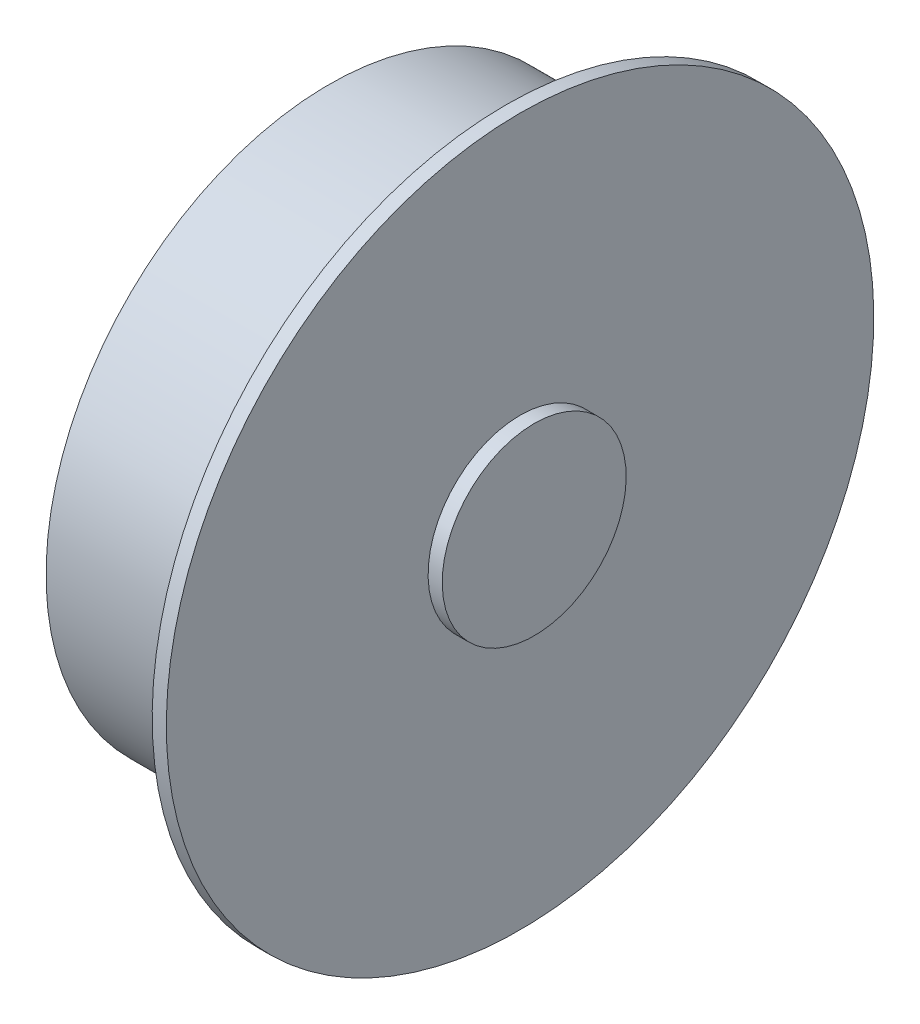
ISO-10303-21;
HEADER;
FILE_DESCRIPTION(('STEP AP214'),'2;1');
FILE_NAME('part.step','',(''),(''),'','','');
FILE_SCHEMA(('AUTOMOTIVE_DESIGN { 1 0 10303 214 1 1 1 1 }'));
ENDSEC;
DATA;
#1=APPLICATION_CONTEXT('core data for automotive mechanical design processes');
#2=APPLICATION_PROTOCOL_DEFINITION('international standard','automotive_design',2000,#1);
#3=PRODUCT_CONTEXT('',#1,'mechanical');
#4=PRODUCT('Part','Part','',(#3));
#5=PRODUCT_RELATED_PRODUCT_CATEGORY('part','',(#4));
#6=PRODUCT_DEFINITION_FORMATION('','',#4);
#7=PRODUCT_DEFINITION_CONTEXT('part definition',#1,'design');
#8=PRODUCT_DEFINITION('design','',#6,#7);
#9=PRODUCT_DEFINITION_SHAPE('','',#8);
#10=(LENGTH_UNIT() NAMED_UNIT(*) SI_UNIT(.MILLI.,.METRE.));
#11=(NAMED_UNIT(*) PLANE_ANGLE_UNIT() SI_UNIT($,.RADIAN.));
#12=(NAMED_UNIT(*) SI_UNIT($,.STERADIAN.) SOLID_ANGLE_UNIT());
#13=UNCERTAINTY_MEASURE_WITH_UNIT(LENGTH_MEASURE(1.E-05),#10,'distance_accuracy_value','');
#14=(GEOMETRIC_REPRESENTATION_CONTEXT(3) GLOBAL_UNCERTAINTY_ASSIGNED_CONTEXT((#13)) GLOBAL_UNIT_ASSIGNED_CONTEXT((#10,
#11,#12)) REPRESENTATION_CONTEXT('',''));
#15=CARTESIAN_POINT('',(0.,0.,0.));
#16=DIRECTION('',(0.,0.,1.));
#17=DIRECTION('',(1.,0.,0.));
#18=AXIS2_PLACEMENT_3D('',#15,#16,#17);
#19=CARTESIAN_POINT('',(4.,0.,0.));
#20=DIRECTION('',(-1.,0.,0.));
#21=DIRECTION('',(0.,-1.,0.));
#22=AXIS2_PLACEMENT_3D('',#19,#20,#21);
#23=CYLINDRICAL_SURFACE('',#22,13.);
#24=CARTESIAN_POINT('',(4.,0.,0.));
#25=DIRECTION('',(1.,0.,0.));
#26=DIRECTION('',(0.,1.,0.));
#27=AXIS2_PLACEMENT_3D('',#24,#25,#26);
#28=CIRCLE('',#27,13.);
#29=CARTESIAN_POINT('',(4.,13.,0.));
#30=VERTEX_POINT('',#29);
#31=EDGE_CURVE('E11',#30,#30,#28,.T.);
#32=ORIENTED_EDGE('',*,*,#31,.F.);
#33=EDGE_LOOP('',(#32));
#34=FACE_BOUND('',#33,.T.);
#35=CARTESIAN_POINT('',(2.,0.,0.));
#36=DIRECTION('',(1.,0.,0.));
#37=DIRECTION('',(0.,1.,0.));
#38=AXIS2_PLACEMENT_3D('',#35,#36,#37);
#39=CIRCLE('',#38,13.);
#40=CARTESIAN_POINT('',(2.,13.,0.));
#41=VERTEX_POINT('',#40);
#42=EDGE_CURVE('E44',#41,#41,#39,.T.);
#43=ORIENTED_EDGE('',*,*,#42,.T.);
#44=EDGE_LOOP('',(#43));
#45=FACE_BOUND('',#44,.T.);
#46=ADVANCED_FACE('F41',(#34,#45),#23,.T.);
#47=CARTESIAN_POINT('',(4.,0.,0.));
#48=DIRECTION('',(1.,0.,0.));
#49=DIRECTION('',(0.,1.,0.));
#50=AXIS2_PLACEMENT_3D('',#47,#48,#49);
#51=PLANE('',#50);
#52=ORIENTED_EDGE('',*,*,#31,.T.);
#53=EDGE_LOOP('',(#52));
#54=FACE_BOUND('',#53,.T.);
#55=ADVANCED_FACE('F56',(#54),#51,.T.);
#56=CARTESIAN_POINT('',(2.,0.,0.));
#57=DIRECTION('',(1.,0.,0.));
#58=DIRECTION('',(0.,1.,0.));
#59=AXIS2_PLACEMENT_3D('',#56,#57,#58);
#60=PLANE('',#59);
#61=ORIENTED_EDGE('',*,*,#42,.F.);
#62=EDGE_LOOP('',(#61));
#63=FACE_BOUND('',#62,.T.);
#64=ADVANCED_FACE('F54',(#63),#60,.F.);
#65=CLOSED_SHELL('',(#46,#55,#64));
#66=MANIFOLD_SOLID_BREP('B2',#65);
#67=CARTESIAN_POINT('',(-25.,0.,0.));
#68=DIRECTION('',(1.,0.,0.));
#69=DIRECTION('',(0.,0.,-1.));
#70=AXIS2_PLACEMENT_3D('',#67,#68,#69);
#71=CYLINDRICAL_SURFACE('',#70,40.);
#72=CARTESIAN_POINT('',(-1.,0.,0.));
#73=DIRECTION('',(1.,0.,0.));
#74=DIRECTION('',(0.,0.,-1.));
#75=AXIS2_PLACEMENT_3D('',#72,#73,#74);
#76=CIRCLE('',#75,40.);
#77=CARTESIAN_POINT('',(-1.,0.,-40.));
#78=VERTEX_POINT('',#77);
#79=EDGE_CURVE('E40',#78,#78,#76,.F.);
#80=ORIENTED_EDGE('',*,*,#79,.T.);
#81=EDGE_LOOP('',(#80));
#82=FACE_BOUND('',#81,.T.);
#83=CARTESIAN_POINT('',(-25.,0.,0.));
#84=DIRECTION('',(1.,0.,0.));
#85=DIRECTION('',(0.,0.,-1.));
#86=AXIS2_PLACEMENT_3D('',#83,#84,#85);
#87=CIRCLE('',#86,40.);
#88=CARTESIAN_POINT('',(-25.,0.,-40.));
#89=VERTEX_POINT('',#88);
#90=EDGE_CURVE('E93',#89,#89,#87,.T.);
#91=ORIENTED_EDGE('',*,*,#90,.T.);
#92=EDGE_LOOP('',(#91));
#93=FACE_BOUND('',#92,.T.);
#94=ADVANCED_FACE('F82',(#82,#93),#71,.T.);
#95=CARTESIAN_POINT('',(-25.,0.,0.));
#96=DIRECTION('',(1.,0.,0.));
#97=DIRECTION('',(0.,0.,-1.));
#98=AXIS2_PLACEMENT_3D('',#95,#96,#97);
#99=PLANE('',#98);
#100=ORIENTED_EDGE('',*,*,#90,.F.);
#101=EDGE_LOOP('',(#100));
#102=FACE_BOUND('',#101,.T.);
#103=ADVANCED_FACE('F122',(#102),#99,.F.);
#104=CARTESIAN_POINT('',(-1.,0.,0.));
#105=DIRECTION('',(1.,0.,0.));
#106=DIRECTION('',(0.,0.,-1.));
#107=AXIS2_PLACEMENT_3D('',#104,#105,#106);
#108=TOROIDAL_SURFACE('',#107,39.,1.);
#109=ORIENTED_EDGE('',*,*,#79,.F.);
#110=EDGE_LOOP('',(#109));
#111=FACE_BOUND('',#110,.T.);
#112=CARTESIAN_POINT('',(0.,0.,0.));
#113=DIRECTION('',(1.,0.,0.));
#114=DIRECTION('',(0.,0.,-1.));
#115=AXIS2_PLACEMENT_3D('',#112,#113,#114);
#116=CIRCLE('',#115,39.);
#117=CARTESIAN_POINT('',(0.,0.,-39.));
#118=VERTEX_POINT('',#117);
#119=EDGE_CURVE('E89',#118,#118,#116,.T.);
#120=ORIENTED_EDGE('',*,*,#119,.F.);
#121=EDGE_LOOP('',(#120));
#122=FACE_BOUND('',#121,.T.);
#123=ADVANCED_FACE('F84',(#111,#122),#108,.T.);
#124=CARTESIAN_POINT('',(2.,0.,0.));
#125=DIRECTION('',(-1.,0.,0.));
#126=DIRECTION('',(0.,-1.,0.));
#127=AXIS2_PLACEMENT_3D('',#124,#125,#126);
#128=CYLINDRICAL_SURFACE('',#127,50.);
#129=CARTESIAN_POINT('',(2.,0.,0.));
#130=DIRECTION('',(1.,0.,0.));
#131=DIRECTION('',(0.,1.,0.));
#132=AXIS2_PLACEMENT_3D('',#129,#130,#131);
#133=CIRCLE('',#132,50.);
#134=CARTESIAN_POINT('',(2.,50.,0.));
#135=VERTEX_POINT('',#134);
#136=EDGE_CURVE('E97',#135,#135,#133,.T.);
#137=ORIENTED_EDGE('',*,*,#136,.F.);
#138=EDGE_LOOP('',(#137));
#139=FACE_BOUND('',#138,.T.);
#140=CARTESIAN_POINT('',(0.,0.,0.));
#141=DIRECTION('',(1.,0.,0.));
#142=DIRECTION('',(0.,1.,0.));
#143=AXIS2_PLACEMENT_3D('',#140,#141,#142);
#144=CIRCLE('',#143,50.);
#145=CARTESIAN_POINT('',(0.,50.,0.));
#146=VERTEX_POINT('',#145);
#147=EDGE_CURVE('E100',#146,#146,#144,.T.);
#148=ORIENTED_EDGE('',*,*,#147,.T.);
#149=EDGE_LOOP('',(#148));
#150=FACE_BOUND('',#149,.T.);
#151=ADVANCED_FACE('F108',(#139,#150),#128,.T.);
#152=CARTESIAN_POINT('',(2.,0.,0.));
#153=DIRECTION('',(1.,0.,0.));
#154=DIRECTION('',(0.,1.,0.));
#155=AXIS2_PLACEMENT_3D('',#152,#153,#154);
#156=PLANE('',#155);
#157=ORIENTED_EDGE('',*,*,#136,.T.);
#158=EDGE_LOOP('',(#157));
#159=FACE_BOUND('',#158,.T.);
#160=ADVANCED_FACE('F106',(#159),#156,.T.);
#161=CARTESIAN_POINT('',(0.,0.,0.));
#162=DIRECTION('',(1.,0.,0.));
#163=DIRECTION('',(0.,1.,0.));
#164=AXIS2_PLACEMENT_3D('',#161,#162,#163);
#165=PLANE('',#164);
#166=ORIENTED_EDGE('',*,*,#119,.T.);
#167=EDGE_LOOP('',(#166));
#168=FACE_BOUND('',#167,.T.);
#169=ORIENTED_EDGE('',*,*,#147,.F.);
#170=EDGE_LOOP('',(#169));
#171=FACE_BOUND('',#170,.T.);
#172=ADVANCED_FACE('F114',(#168,#171),#165,.F.);
#173=CLOSED_SHELL('',(#94,#103,#123,#151,#160,#172));
#174=MANIFOLD_SOLID_BREP('B6',#173);
#175=ADVANCED_BREP_SHAPE_REPRESENTATION('',(#18,#66,#174),#14);
#176=SHAPE_DEFINITION_REPRESENTATION(#9,#175);
ENDSEC;
END-ISO-10303-21;
